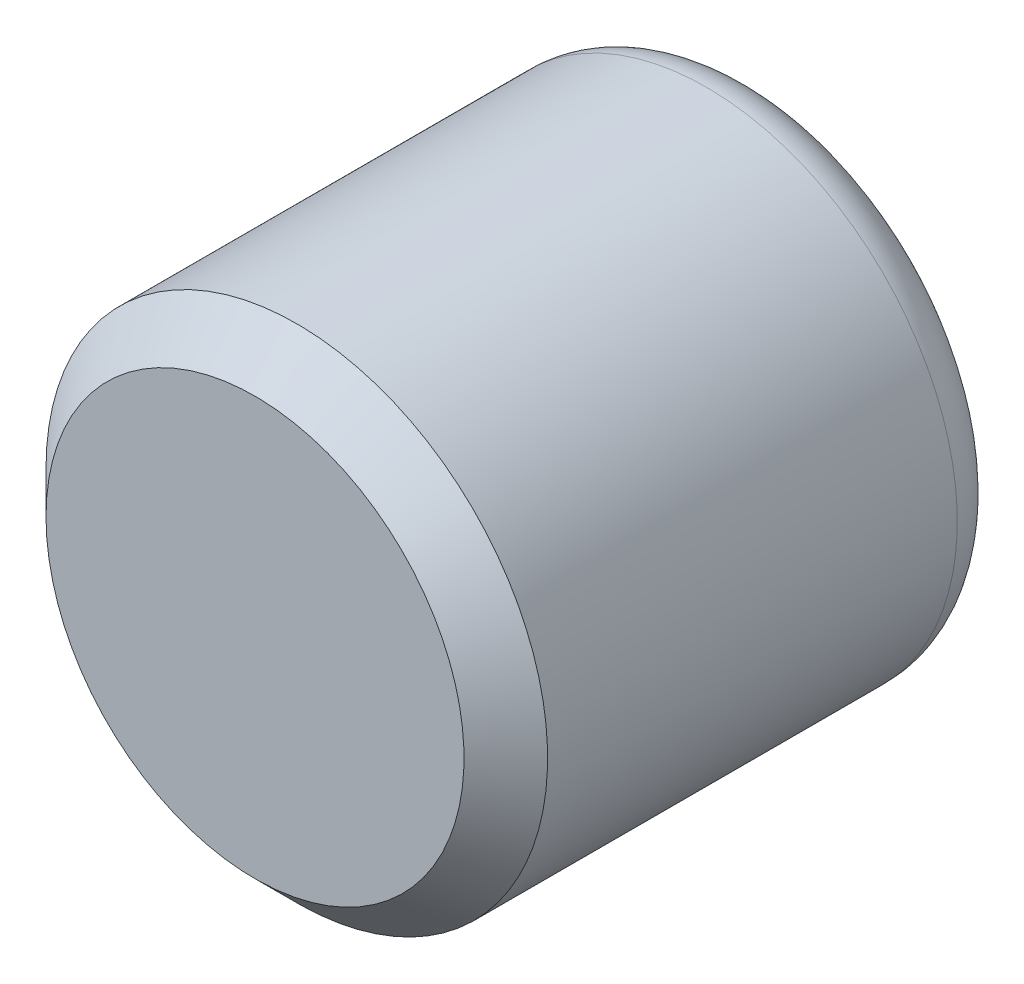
from build123d import *

# Parameters (mm, degrees)
ENLEV_MAT_EXTRU1_DEPTH = 4
CHANFREIN1_SIZE        = 0.5


with BuildPart() as part:
    # Esquisse1 → Base-R_volution (revolve)
    with BuildSketch(Plane(origin=(0, 0, 0), x_dir=(1, 0, 0), z_dir=(0, 1, 0)), mode=Mode.PRIVATE) as base_r_volution_sk:
        with BuildLine():
            Line((0, 0), (3, 0))
            Line((3, 0), (3, 5.4))
            ThreePointArc((3, 5.4), (2.824264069, 5.824264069), (2.4, 6))
            Line((2.4, 6), (0, 6))
            Line((0, 6), (0, 0))
        make_face()
    revolve(base_r_volution_sk.sketch.rotate(Axis((0, 0, 0), (0, 0, -1)), 180), axis=Axis((0, 0, 0), (0, 0, -1)))

    # Esquisse2 → enlev-mat-Extru1 (cut)
    with BuildSketch(Plane.XY.offset(-6)):
        Polygon((2, -1.154700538), (2, 1.154700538), (0, 2.309401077), (-2, 1.154700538), (-2, -1.154700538), (0, -2.309401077), align=None)
    extrude(amount=ENLEV_MAT_EXTRU1_DEPTH, mode=Mode.SUBTRACT)

    # Chanfrein1
    chanfrein1_edges = [part.edges().sort_by_distance(p)[0] for p in [
        (3, 0, 0),
    ]]
    chamfer(chanfrein1_edges, length=CHANFREIN1_SIZE)


solid = part.part
